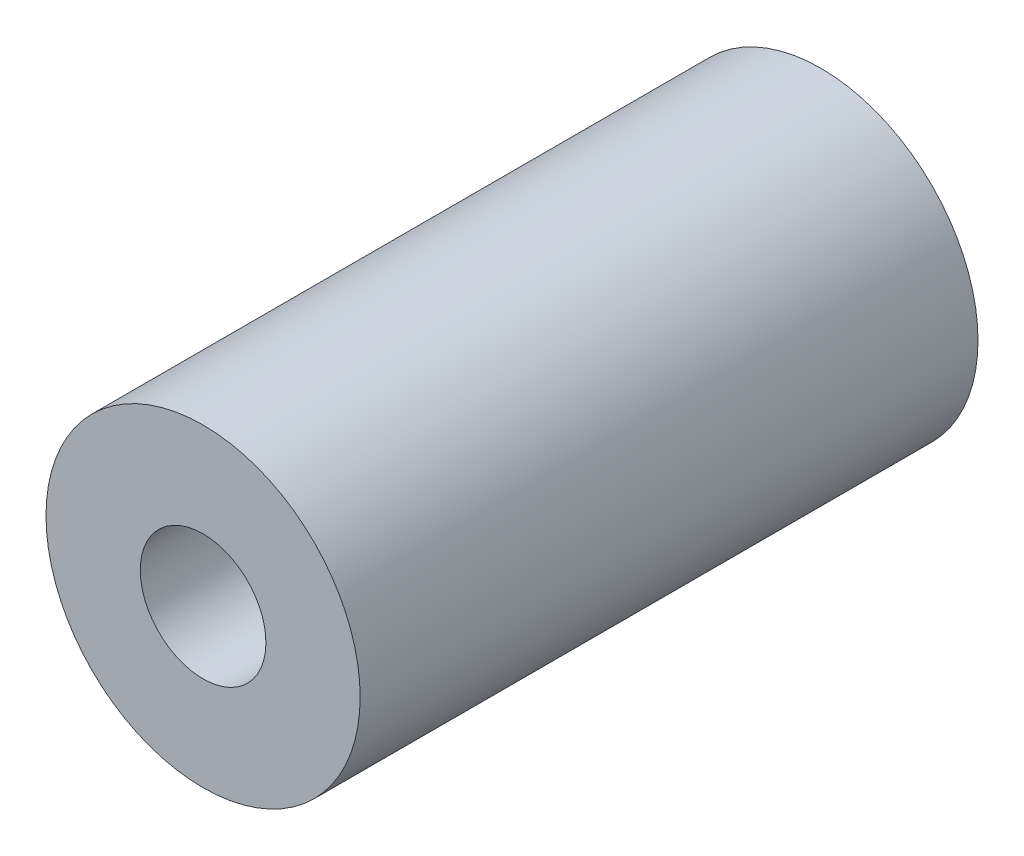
ISO-10303-21;
HEADER;
FILE_DESCRIPTION(('STEP AP214'),'2;1');
FILE_NAME('part.step','',(''),(''),'','','');
FILE_SCHEMA(('AUTOMOTIVE_DESIGN { 1 0 10303 214 1 1 1 1 }'));
ENDSEC;
DATA;
#1=APPLICATION_CONTEXT('core data for automotive mechanical design processes');
#2=APPLICATION_PROTOCOL_DEFINITION('international standard','automotive_design',2000,#1);
#3=PRODUCT_CONTEXT('',#1,'mechanical');
#4=PRODUCT('Part','Part','',(#3));
#5=PRODUCT_RELATED_PRODUCT_CATEGORY('part','',(#4));
#6=PRODUCT_DEFINITION_FORMATION('','',#4);
#7=PRODUCT_DEFINITION_CONTEXT('part definition',#1,'design');
#8=PRODUCT_DEFINITION('design','',#6,#7);
#9=PRODUCT_DEFINITION_SHAPE('','',#8);
#10=(LENGTH_UNIT() NAMED_UNIT(*) SI_UNIT(.MILLI.,.METRE.));
#11=(NAMED_UNIT(*) PLANE_ANGLE_UNIT() SI_UNIT($,.RADIAN.));
#12=(NAMED_UNIT(*) SI_UNIT($,.STERADIAN.) SOLID_ANGLE_UNIT());
#13=UNCERTAINTY_MEASURE_WITH_UNIT(LENGTH_MEASURE(1.E-05),#10,'distance_accuracy_value','');
#14=(GEOMETRIC_REPRESENTATION_CONTEXT(3) GLOBAL_UNCERTAINTY_ASSIGNED_CONTEXT((#13)) GLOBAL_UNIT_ASSIGNED_CONTEXT((#10,
#11,#12)) REPRESENTATION_CONTEXT('',''));
#15=CARTESIAN_POINT('',(0.,0.,0.));
#16=DIRECTION('',(0.,0.,1.));
#17=DIRECTION('',(1.,0.,0.));
#18=AXIS2_PLACEMENT_3D('',#15,#16,#17);
#19=CARTESIAN_POINT('',(0.,0.,0.));
#20=DIRECTION('',(0.,0.,-1.));
#21=DIRECTION('',(0.,1.,0.));
#22=AXIS2_PLACEMENT_3D('',#19,#20,#21);
#23=CYLINDRICAL_SURFACE('',#22,15.);
#24=CARTESIAN_POINT('',(0.,0.,59.));
#25=DIRECTION('',(0.,0.,-1.));
#26=DIRECTION('',(0.,1.,0.));
#27=AXIS2_PLACEMENT_3D('',#24,#25,#26);
#28=CIRCLE('',#27,15.);
#29=CARTESIAN_POINT('',(0.,15.,59.));
#30=VERTEX_POINT('',#29);
#31=EDGE_CURVE('E26',#30,#30,#28,.T.);
#32=ORIENTED_EDGE('',*,*,#31,.T.);
#33=EDGE_LOOP('',(#32));
#34=FACE_BOUND('',#33,.T.);
#35=CARTESIAN_POINT('',(0.,0.,0.));
#36=DIRECTION('',(0.,0.,-1.));
#37=DIRECTION('',(0.,1.,0.));
#38=AXIS2_PLACEMENT_3D('',#35,#36,#37);
#39=CIRCLE('',#38,15.);
#40=CARTESIAN_POINT('',(0.,15.,0.));
#41=VERTEX_POINT('',#40);
#42=EDGE_CURVE('E18',#41,#41,#39,.T.);
#43=ORIENTED_EDGE('',*,*,#42,.F.);
#44=EDGE_LOOP('',(#43));
#45=FACE_BOUND('',#44,.T.);
#46=ADVANCED_FACE('F12',(#34,#45),#23,.T.);
#47=CARTESIAN_POINT('',(8.,0.,0.));
#48=DIRECTION('',(0.,0.,-1.));
#49=DIRECTION('',(0.,1.,0.));
#50=AXIS2_PLACEMENT_3D('',#47,#48,#49);
#51=PLANE('',#50);
#52=ORIENTED_EDGE('',*,*,#42,.T.);
#53=EDGE_LOOP('',(#52));
#54=FACE_BOUND('',#53,.T.);
#55=ADVANCED_FACE('F48',(#54),#51,.T.);
#56=CARTESIAN_POINT('',(0.,0.,0.));
#57=DIRECTION('',(0.,0.,-1.));
#58=DIRECTION('',(0.,1.,0.));
#59=AXIS2_PLACEMENT_3D('',#56,#57,#58);
#60=CYLINDRICAL_SURFACE('',#59,6.);
#61=CARTESIAN_POINT('',(0.,0.,59.));
#62=DIRECTION('',(0.,0.,-1.));
#63=DIRECTION('',(0.,1.,0.));
#64=AXIS2_PLACEMENT_3D('',#61,#62,#63);
#65=CIRCLE('',#64,6.);
#66=CARTESIAN_POINT('',(0.,6.,59.));
#67=VERTEX_POINT('',#66);
#68=EDGE_CURVE('E22',#67,#67,#65,.T.);
#69=ORIENTED_EDGE('',*,*,#68,.F.);
#70=EDGE_LOOP('',(#69));
#71=FACE_BOUND('',#70,.T.);
#72=CARTESIAN_POINT('',(0.,0.,44.));
#73=DIRECTION('',(0.,0.,-1.));
#74=DIRECTION('',(0.,1.,0.));
#75=AXIS2_PLACEMENT_3D('',#72,#73,#74);
#76=CIRCLE('',#75,6.);
#77=CARTESIAN_POINT('',(0.,6.,44.));
#78=VERTEX_POINT('',#77);
#79=EDGE_CURVE('E8',#78,#78,#76,.T.);
#80=ORIENTED_EDGE('',*,*,#79,.T.);
#81=EDGE_LOOP('',(#80));
#82=FACE_BOUND('',#81,.T.);
#83=ADVANCED_FACE('F37',(#71,#82),#60,.F.);
#84=CARTESIAN_POINT('',(6.,0.,59.));
#85=DIRECTION('',(0.,0.,1.));
#86=DIRECTION('',(0.,-1.,0.));
#87=AXIS2_PLACEMENT_3D('',#84,#85,#86);
#88=PLANE('',#87);
#89=ORIENTED_EDGE('',*,*,#68,.T.);
#90=EDGE_LOOP('',(#89));
#91=FACE_BOUND('',#90,.T.);
#92=ORIENTED_EDGE('',*,*,#31,.F.);
#93=EDGE_LOOP('',(#92));
#94=FACE_BOUND('',#93,.T.);
#95=ADVANCED_FACE('F34',(#91,#94),#88,.T.);
#96=CARTESIAN_POINT('',(0.,0.,44.));
#97=DIRECTION('',(0.,0.,-1.));
#98=DIRECTION('',(0.,1.,0.));
#99=AXIS2_PLACEMENT_3D('',#96,#97,#98);
#100=PLANE('',#99);
#101=ORIENTED_EDGE('',*,*,#79,.F.);
#102=EDGE_LOOP('',(#101));
#103=FACE_BOUND('',#102,.T.);
#104=ADVANCED_FACE('F36',(#103),#100,.F.);
#105=CLOSED_SHELL('',(#46,#55,#83,#95,#104));
#106=MANIFOLD_SOLID_BREP('B1',#105);
#107=ADVANCED_BREP_SHAPE_REPRESENTATION('',(#18,#106),#14);
#108=SHAPE_DEFINITION_REPRESENTATION(#9,#107);
ENDSEC;
END-ISO-10303-21;
